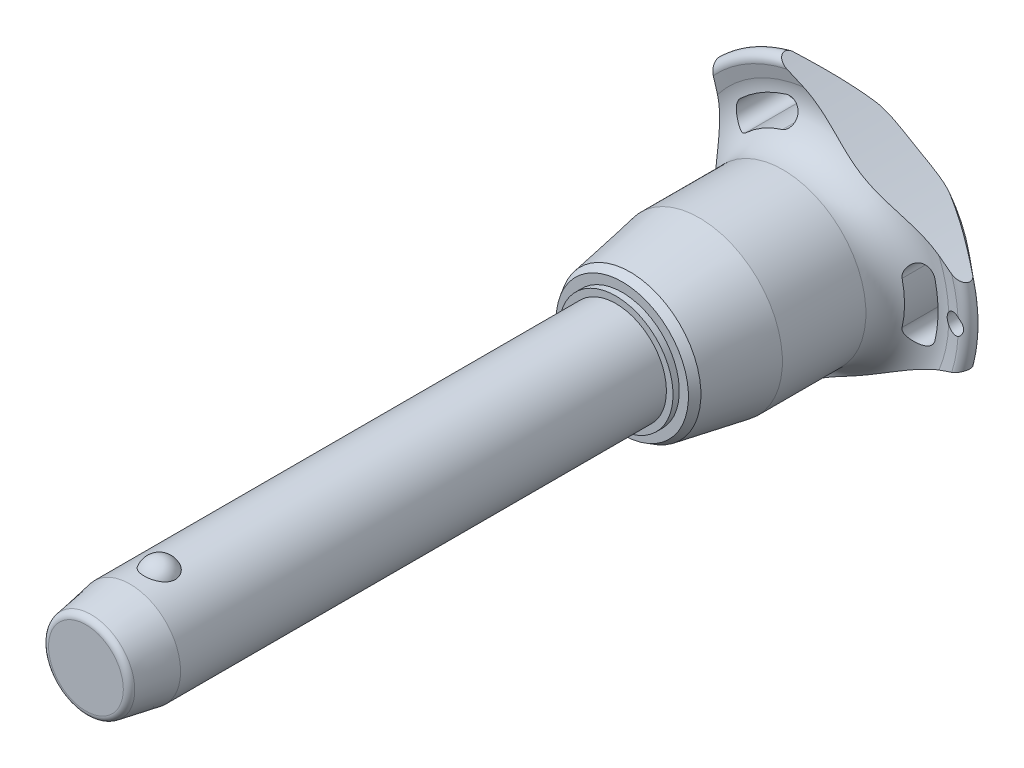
from build123d import *

# Parameters (mm, degrees)
SKETCH1_R           = 8
BOSS_EXTRUDE1_DEPTH = 70
SKETCH2_R           = 7
BOSS_EXTRUDE2_DEPTH = 39.7
BOSS_EXTRUDE3_START = 14
SKETCH1_2_R         = 8
BOSS_EXTRUDE3_DEPTH = 14
CHAMFER1_SIZE       = 7
CHAMFER1_SIZE2      = 1.234288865
FILLET1_R           = 1
SKETCH6_R           = 144.275
CUT_EXTRUDE1_DEPTH  = 115.750268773
CIRPATTERN1_COUNT   = 3
SKETCH7_R           = 1.5
CUT_EXTRUDE2_DEPTH  = 115.575242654


with BuildPart() as part:
    # Sketch1 → Boss-Extrude1 (new body)
    with BuildSketch(Plane.XY):
        Circle(SKETCH1_R)
    extrude(amount=-BOSS_EXTRUDE1_DEPTH)

    # Sketch2 → Boss-Extrude2 (add)
    with BuildSketch(Plane(origin=(0, 0, -70), x_dir=(-1, 0, 0), z_dir=(0, 0, -1))):
        Circle(SKETCH2_R)
    extrude(amount=BOSS_EXTRUDE2_DEPTH)

    # Sketch3 → Revolve1 (revolve)
    with BuildSketch(Plane(origin=(0, 0, 0), x_dir=(0, 0, -1), z_dir=(1, 0, 0))):
        with BuildLine():
            Line((-2.387467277, 9.5), (-2.387467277, 4.2))
            ThreePointArc((-2.387467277, 4.2), (0.262532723, 6.85), (-2.387467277, 9.5))
        make_face()
        with BuildLine():
            Line((-2.387467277, -4.2), (-2.387467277, -9.5))
            ThreePointArc((-2.387467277, -9.5), (0.262532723, -6.85), (-2.387467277, -4.2))
        make_face()
    revolve(axis=Axis((0, -4.2, 2.387467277), (0, 1, 0)))

    # Sketch1_2 → Boss-Extrude3 (add)
    with BuildSketch(Plane.XY.offset(BOSS_EXTRUDE3_START)):
        Circle(SKETCH1_2_R)
    extrude(amount=-BOSS_EXTRUDE3_DEPTH)

    # Chamfer1
    chamfer1_edges = [part.edges().sort_by_distance(p)[0] for p in [
        (-8, 0, 14),
    ]]
    chamfer1_side = [part.faces().sort_by_distance(p)[0] for p in [
        (-8, 0, -28),
    ]]
    chamfer(chamfer1_edges, length=CHAMFER1_SIZE, length2=CHAMFER1_SIZE2, reference=chamfer1_side[0])

    # Fillet1
    fillet1_edges = [part.edges().sort_by_distance(p)[0] for p in [
        (-6.765711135, 0, 14),
        (7, 0, -109.7),
    ]]
    fillet(fillet1_edges, radius=FILLET1_R)

    # Sketch4 → Revolve2 (revolve)
    with BuildSketch(Plane(origin=(0, 0, 0), x_dir=(0, 0, -1), z_dir=(1, 0, 0)), mode=Mode.PRIVATE) as revolve2_sk:
        Polygon((70, 0), (70, 9.044607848), (71, 9.044607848), (71, 10.490707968), (72.25235944, 11.213758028), (83.233333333, 13.15), (96.466666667, 13.15), (96.466666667, 0), align=None)
    revolve(revolve2_sk.sketch.rotate(Axis((0, 0, -96.466666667), (0, 0, 1)), 90), axis=Axis((0, 0, -96.466666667), (0, 0, 1)))

    # Sketch5 → Revolve3 (revolve)
    with BuildSketch(Plane(origin=(0, 0, 0), x_dir=(0, 0, -1), z_dir=(1, 0, 0)), mode=Mode.PRIVATE) as revolve3_sk:
        with BuildLine():
            Line((102.32877039, 20.428960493), (101.910912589, 22.344207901))
            ThreePointArc((101.910912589, 22.344207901), (102.554394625, 23.677136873), (104.002586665, 23.371345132))
            Line((104.002586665, 23.371345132), (109.141488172, 17.247040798))
            ThreePointArc((109.141488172, 17.247040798), (109.7, 15.584758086), (108.978803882, 13.986322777))
            ThreePointArc((108.978803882, 13.986322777), (104.617427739, 7.589034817), (103.083333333, 0))
            Line((103.083333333, 0), (96.466666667, 0))
            Line((96.466666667, 0), (96.466666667, 13.15))
            ThreePointArc((96.466666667, 13.15), (101.139661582, 15.38660811), (102.32877039, 20.428960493))
        make_face()
    revolve(revolve3_sk.sketch.rotate(Axis((0, 0, -103.083333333), (0, 0, 1)), 90), axis=Axis((0, 0, -103.083333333), (0, 0, 1)))

    # Sketch6 → Cut-Extrude1 (cut, through all)
    with BuildSketch(Plane.XY):
        with Locations((-159.975, 0)):
            Circle(SKETCH6_R)
        with BuildLine():
            ThreePointArc((18.131206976, -4.190753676), (18.60922037, 0), (18.131206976, 4.190753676))
            ThreePointArc((18.131206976, 4.190753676), (15.94840906, 5.553949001), (14.585213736, 3.371151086))
            ThreePointArc((14.585213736, 3.371151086), (14.969740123, 0), (14.585213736, -3.371151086))
            ThreePointArc((14.585213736, -3.371151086), (15.94840906, -5.553949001), (18.131206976, -4.190753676))
        make_face()
    cut_extrude1 = extrude(amount=-CUT_EXTRUDE1_DEPTH, mode=Mode.SUBTRACT)

    # CirPattern1: Cut-Extrude1 ×3 about axis
    cirpattern1_axis = Axis((0, 0, 0), (0, 0, 1))
    for i in range(1, CIRPATTERN1_COUNT):
        add(cut_extrude1.rotate(cirpattern1_axis, i * 360 / CIRPATTERN1_COUNT), mode=Mode.SUBTRACT)

    # Sketch7 → Cut-Extrude2 (cut, through all)
    with BuildSketch(Plane.XY):
        with Locations(Location((21.60922037, 0, 0), (0, 0, 297.620773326))):
            Circle(SKETCH7_R)
    extrude(amount=-CUT_EXTRUDE2_DEPTH, mode=Mode.SUBTRACT)


solid = part.part
